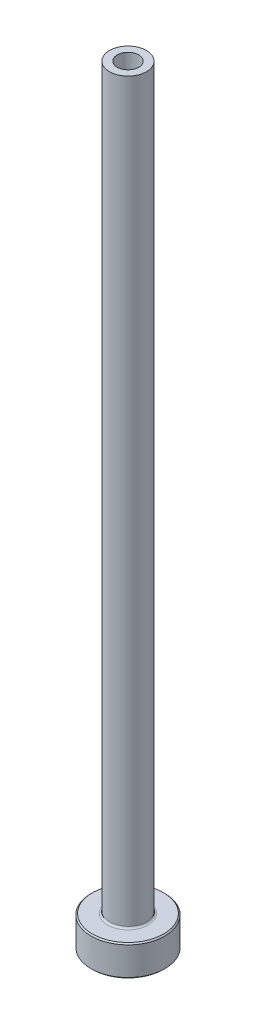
from build123d import *

# Parameters (mm, degrees)
FILLET1_R     = 0.3
CHAMFER1_SIZE = 0.2
CHAMFER3_SIZE = 0.5


with BuildPart() as part:
    # Sketch1 → Revolve1 (revolve)
    with BuildSketch(Plane.XY, mode=Mode.PRIVATE) as revolve1_sk:
        Polygon((-1.75, 125), (-3, 125), (-3, 5), (-6, 5), (-6, 0), (-2, 0), (-2, 68), (-1.75, 80), align=None)
    revolve(revolve1_sk.sketch.rotate(Axis((0, 92.187680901, 0), (0, -1, 0)), 270), axis=Axis((0, 92.187680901, 0), (0, -1, 0)))

    # Fillet1
    fillet1_edges = [part.edges().sort_by_distance(p)[0] for p in [
        (0, 5, -3),
    ]]
    fillet(fillet1_edges, radius=FILLET1_R)

    # Chamfer1
    chamfer1_edges = [part.edges().sort_by_distance(p)[0] for p in [
        (0, 0, -6),
        (0, 5, -6),
    ]]
    chamfer(chamfer1_edges, length=CHAMFER1_SIZE)

    # Chamfer3
    chamfer3_edges = [part.edges().sort_by_distance(p)[0] for p in [
        (0, 0, -2),
    ]]
    chamfer(chamfer3_edges, length=CHAMFER3_SIZE)


solid = part.part
